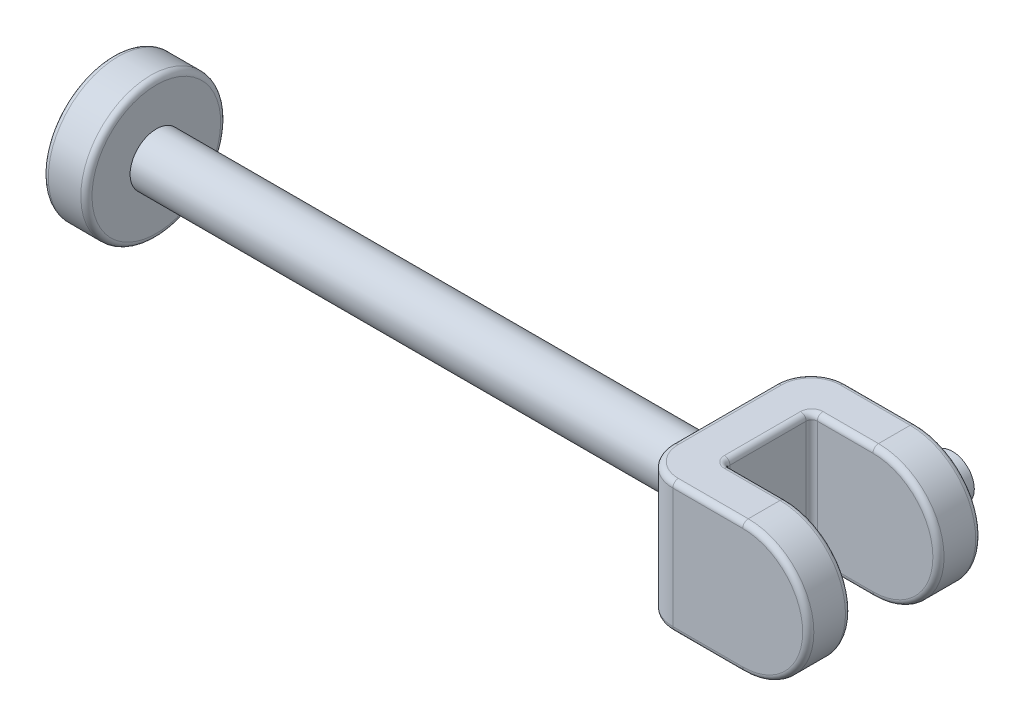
from build123d import *

# Parameters (mm, degrees)
BOSS_EXTRUDE1_DEPTH = 6.2865
SKETCH4_R           = 1.5875
BOSS_EXTRUDE2_DEPTH = 15.24
FILLET1_R           = 2.54
SKETCH5_W           = 13.335
SKETCH5_H           = 6.35
CUT_EXTRUDE1_DEPTH  = 59.369281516
FILLET2_R           = 0.4064


with BuildPart() as part:
    # Sketch2 → Revolve1 (revolve)
    with BuildSketch(Plane.XY):
        Polygon((44.45, 1.905), (3.175, 1.905), (3.175, 5.08), (0, 5.08), (0, 0), (44.45, 0), align=None)
    revolve(axis=Axis((54.61, 0, 0), (-1, 0, 0)))

    # Sketch3 → Boss-Extrude1 (add, symmetric)
    with BuildSketch(Plane.XY):
        with BuildLine():
            Line((44.45, 4.7625), (44.45, -4.7625))
            Line((44.45, -4.7625), (52.07, -4.7625))
            ThreePointArc((52.07, -4.7625), (56.8325, 0), (52.07, 4.7625))
            Line((52.07, 4.7625), (44.45, 4.7625))
        make_face()
    extrude(amount=BOSS_EXTRUDE1_DEPTH, both=True)

    # Sketch4 → Boss-Extrude2 (add)
    with BuildSketch(Plane.XY.offset(6.2865)):
        with Locations((52.07, 0)):
            Circle(SKETCH4_R)
    extrude(amount=-BOSS_EXTRUDE2_DEPTH)

    # Fillet1
    fillet1_edges = [part.edges().sort_by_distance(p)[0] for p in [
        (44.45, 0, -6.2865),
        (44.45, 0, 6.2865),
    ]]
    fillet(fillet1_edges, radius=FILLET1_R)

    # Sketch5 → Cut-Extrude1 (cut, through all)
    with BuildSketch(Plane(origin=(0, 4.7625, 0), x_dir=(1, 0, 0), z_dir=(0, 1, 0))):
        with Locations((54.2925, 0)):
            Rectangle(SKETCH5_W, SKETCH5_H)
    extrude(amount=-CUT_EXTRUDE1_DEPTH, mode=Mode.SUBTRACT)

    # Fillet2
    fillet2_edges = [part.edges().sort_by_distance(p)[0] for p in [
        (49.53, 4.7625, -6.2865),
        (56.8325, 0, -6.2865),
        (56.8325, 0, 6.2865),
        (49.53, 4.7625, 6.2865),
        (49.53, -4.7625, 6.2865),
        (44.45, -4.7625, 0),
        (49.53, -4.7625, -6.2865),
        (45.193948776, -4.7625, -5.542551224),
        (45.193948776, -4.7625, 5.542551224),
        (44.45, 4.7625, 0),
        (45.193948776, 4.7625, -5.542551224),
        (45.193948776, 4.7625, 5.542551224),
        (56.8325, 0, -3.175),
        (56.8325, 0, 3.175),
        (47.625, -4.7625, 0),
        (49.8475, -4.7625, 3.175),
        (49.8475, -4.7625, -3.175),
        (47.625, 0, 3.175),
        (47.625, 0, -3.175),
        (49.8475, 4.7625, 3.175),
        (49.8475, 4.7625, -3.175),
        (47.625, 4.7625, 0),
        (0, -5.08, 0),
        (3.175, -5.08, 0),
    ]]
    fillet(fillet2_edges, radius=FILLET2_R)


solid = part.part
